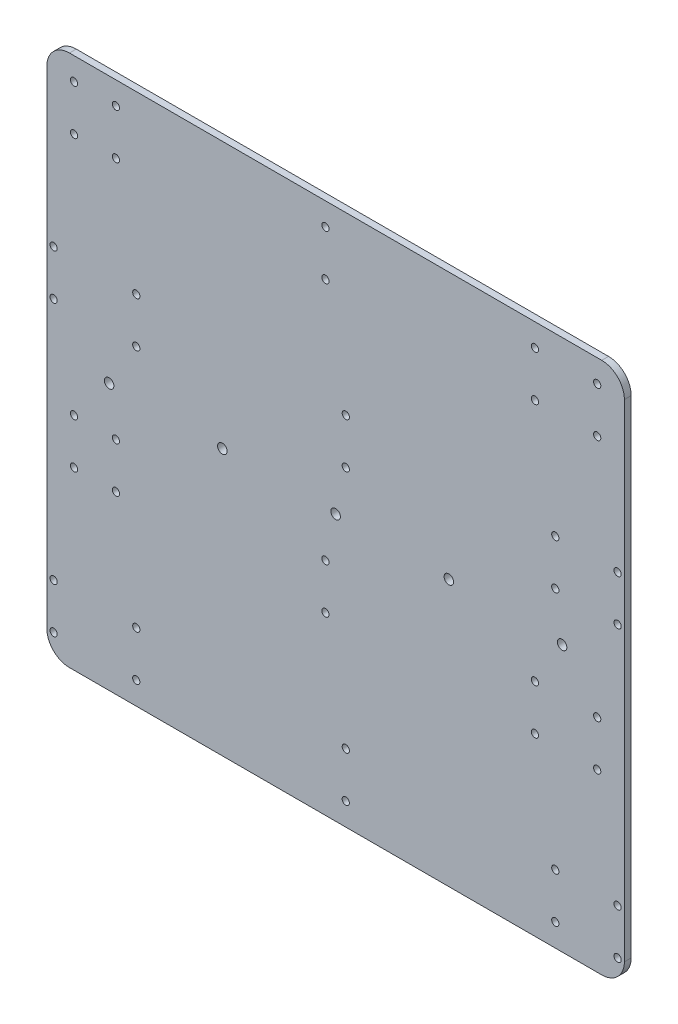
from build123d import *

# Parameters (mm, degrees)
SKETCH_1_W           = 360
SKETCH_1_H           = 275
EXTRUDE_1_DEPTH      = 3
SKETCH_3_R           = 1.6
CUT_EXTRUDE_1_DEPTH  = 3
SKETCH_5_W           = 360
SKETCH_5_H           = 3
EXTRUDE_2_DEPTH      = 5
SKETCH_6_W           = 360
SKETCH_6_H           = 3
EXTRUDE_3_DEPTH      = 5
SKETCH_7_R           = 2.1
CUT_EXTRUDE_2_DEPTH  = 10
SKETCH_8_OUTSIDE_W   = 453.834
SKETCH_8_OUTSIDE_H   = 378.834
SKETCH_8_OUTSIDE_W_2 = 255
SKETCH_8_OUTSIDE_H_2 = 235
CUT_EXTRUDE_3_DEPTH  = 10
FILLET_1_R           = 10


with BuildPart() as part:
    # Sketch 1 → Extrude 1 (new body)
    with BuildSketch(Plane.XY):
        with Locations((180, 137.5)):
            Rectangle(SKETCH_1_W, SKETCH_1_H)
    extrude(amount=EXTRUDE_1_DEPTH)

    # Sketch 3 → Cut-Extrude 1 (cut)
    with BuildSketch(Plane.XY.offset(3)):
        with Locations((175.5, 245)):
            Circle(SKETCH_3_R)
        with Locations((175.5, 225)):
            Circle(SKETCH_3_R)
        with Locations((184.5, 177.5)):
            Circle(SKETCH_3_R)
        with Locations((184.5, 157.5)):
            Circle(SKETCH_3_R)
        with Locations((184.5, 30)):
            Circle(SKETCH_3_R)
        with Locations((184.5, 50)):
            Circle(SKETCH_3_R)
        with Locations((175.5, 97.5)):
            Circle(SKETCH_3_R)
        with Locations((175.5, 117.5)):
            Circle(SKETCH_3_R)
        with Locations((295.5, 245)):
            Circle(SKETCH_3_R)
        with Locations((295.5, 225)):
            Circle(SKETCH_3_R)
        with Locations((304.5, 177.5)):
            Circle(SKETCH_3_R)
        with Locations((304.5, 157.5)):
            Circle(SKETCH_3_R)
        with Locations((304.5, 30)):
            Circle(SKETCH_3_R)
        with Locations((304.5, 50)):
            Circle(SKETCH_3_R)
        with Locations((295.5, 97.5)):
            Circle(SKETCH_3_R)
        with Locations((295.5, 117.5)):
            Circle(SKETCH_3_R)
        with Locations(Location((64.5, 117.5, 0), (0, 0, 180))):
            Circle(SKETCH_3_R)
        with Locations(Location((64.5, 97.5, 0), (0, 0, 180))):
            Circle(SKETCH_3_R)
        with Locations(Location((55.5, 50, 0), (0, 0, 180))):
            Circle(SKETCH_3_R)
        with Locations(Location((55.5, 30, 0), (0, 0, 180))):
            Circle(SKETCH_3_R)
        with Locations(Location((55.5, 157.5, 0), (0, 0, 180))):
            Circle(SKETCH_3_R)
        with Locations(Location((55.5, 177.5, 0), (0, 0, 180))):
            Circle(SKETCH_3_R)
        with Locations(Location((64.5, 225, 0), (0, 0, 180))):
            Circle(SKETCH_3_R)
        with Locations(Location((64.5, 245, 0), (0, 0, 180))):
            Circle(SKETCH_3_R)
        with Locations((268, 245)):
            Circle(SKETCH_3_R)
        with Locations((268, 225)):
            Circle(SKETCH_3_R)
        with Locations((277, 177.5)):
            Circle(SKETCH_3_R)
        with Locations((277, 157.5)):
            Circle(SKETCH_3_R)
        with Locations((277, 30)):
            Circle(SKETCH_3_R)
        with Locations((277, 50)):
            Circle(SKETCH_3_R)
        with Locations((268, 97.5)):
            Circle(SKETCH_3_R)
        with Locations((268, 117.5)):
            Circle(SKETCH_3_R)
        with Locations((83, 245)):
            Circle(SKETCH_3_R)
        with Locations((83, 225)):
            Circle(SKETCH_3_R)
        with Locations((92, 177.5)):
            Circle(SKETCH_3_R)
        with Locations((92, 157.5)):
            Circle(SKETCH_3_R)
        with Locations((92, 30)):
            Circle(SKETCH_3_R)
        with Locations((92, 50)):
            Circle(SKETCH_3_R)
        with Locations((83, 97.5)):
            Circle(SKETCH_3_R)
        with Locations((83, 117.5)):
            Circle(SKETCH_3_R)
    extrude(amount=-CUT_EXTRUDE_1_DEPTH, mode=Mode.SUBTRACT)

    # Sketch 5 → Extrude 2 (add)
    with BuildSketch(Plane(origin=(0, 275, 0), x_dir=(1, 0, 0), z_dir=(0, 1, 0))):
        with Locations((180, -1.5)):
            Rectangle(SKETCH_5_W, SKETCH_5_H)
    extrude(amount=EXTRUDE_2_DEPTH)

    # Sketch 6 → Extrude 3 (add)
    with BuildSketch(Plane.XZ):
        with Locations((180, 1.5)):
            Rectangle(SKETCH_6_W, SKETCH_6_H)
    extrude(amount=EXTRUDE_3_DEPTH)

    # Sketch 7 → Cut-Extrude 2 (cut)
    with BuildSketch(Plane.XY.offset(3)):
        with Locations((180, 5)):
            Circle(SKETCH_7_R)
        with Locations((130, 5)):
            Circle(SKETCH_7_R)
        with Locations((80, 5)):
            Circle(SKETCH_7_R)
        with Locations(Location((280, 5, 0), (0, 0, 180))):
            Circle(SKETCH_7_R)
        with Locations(Location((230, 5, 0), (0, 0, 180))):
            Circle(SKETCH_7_R)
        with Locations((230, 270)):
            Circle(SKETCH_7_R)
        with Locations((280, 270)):
            Circle(SKETCH_7_R)
        with Locations(Location((80, 270, 0), (0, 0, 180))):
            Circle(SKETCH_7_R)
        with Locations(Location((130, 270, 0), (0, 0, 180))):
            Circle(SKETCH_7_R)
        with Locations(Location((180, 270, 0), (0, 0, 180))):
            Circle(SKETCH_7_R)
        with Locations(Location((280, 137.5, 0), (0, 0, 180))):
            Circle(SKETCH_7_R)
        with Locations((80, 137.5)):
            Circle(SKETCH_7_R)
        with Locations(Location((230, 137.5, 0), (0, 0, 180))):
            Circle(SKETCH_7_R)
        with Locations((130, 137.5)):
            Circle(SKETCH_7_R)
        with Locations((180, 137.5)):
            Circle(SKETCH_7_R)
    extrude(amount=-CUT_EXTRUDE_2_DEPTH, mode=Mode.SUBTRACT)

    # Sketch 8 outside → Cut-Extrude 3 (cut)
    with BuildSketch(Plane.XY.offset(3)):
        with Locations((180, 137.5)):
            Rectangle(SKETCH_8_OUTSIDE_W, SKETCH_8_OUTSIDE_H)
        with Locations((180, 137.5)):
            Rectangle(SKETCH_8_OUTSIDE_W_2, SKETCH_8_OUTSIDE_H_2, mode=Mode.SUBTRACT)
    extrude(amount=-CUT_EXTRUDE_3_DEPTH, mode=Mode.SUBTRACT)

    # Fillet 1
    fillet_1_edges = [part.edges().sort_by_distance(p)[0] for p in [
        (307.5, 20, 1.5),
        (52.5, 20, 1.5),
        (52.5, 255, 1.5),
        (307.5, 255, 1.5),
    ]]
    fillet(fillet_1_edges, radius=FILLET_1_R)


solid = part.part
